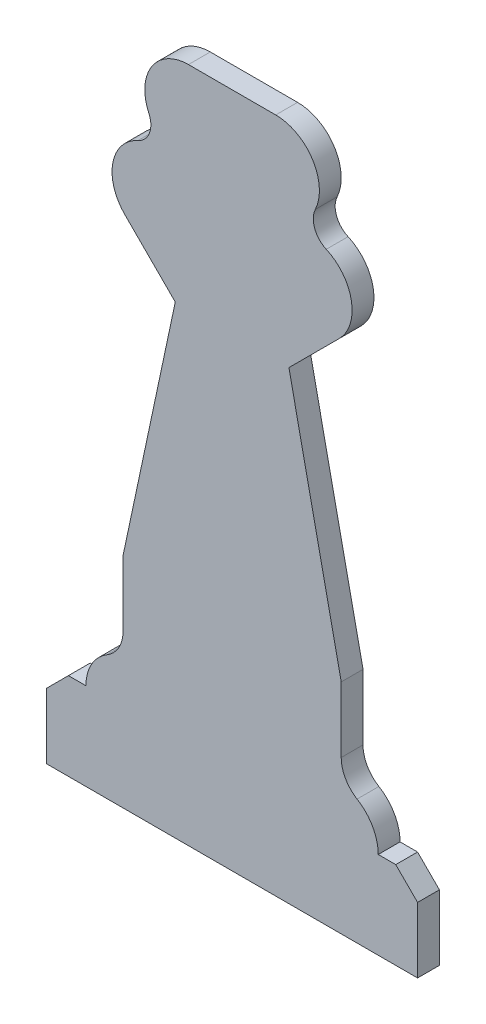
from build123d import *

# Parameters (mm, degrees)
SALIENTE_EXTRUIR1_DEPTH = 2


with BuildPart() as part:
    # Peon → Saliente-Extruir1 (new body)
    with BuildSketch(Plane.XY):
        with BuildLine():
            Line((-17, 0), (17, 0))
            Line((17, 0), (17, 6))
            Line((17, 6), (15, 8))
            Line((15, 8), (13.394448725, 8))
            ThreePointArc((13.394448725, 8), (12.875918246, 9.969611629), (11.454763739, 11.428571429))
            ThreePointArc((11.454763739, 11.428571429), (10.388897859, 12.522791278), (10, 14))
            Line((10, 14), (10, 20))
            Line((10, 20), (5.206850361, 42.549996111))
            Line((5.206850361, 42.549996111), (9.828427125, 47.171572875))
            ThreePointArc((9.828427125, 47.171572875), (10.933312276, 50.727361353), (8.629883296, 53.652872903))
            ThreePointArc((8.629883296, 53.652872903), (7.572166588, 54.777062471), (7.629883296, 56.319539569))
            ThreePointArc((7.629883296, 56.319539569), (7.370596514, 60.153852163), (4, 62))
            Line((4, 62), (-4, 62))
            ThreePointArc((-4, 62), (-7.370596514, 60.153852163), (-7.629883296, 56.319539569))
            ThreePointArc((-7.629883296, 56.319539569), (-7.572166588, 54.777062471), (-8.629883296, 53.652872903))
            ThreePointArc((-8.629883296, 53.652872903), (-10.933312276, 50.727361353), (-9.828427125, 47.171572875))
            Line((-9.828427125, 47.171572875), (-5.206850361, 42.549996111))
            Line((-5.206850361, 42.549996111), (-10, 20))
            Line((-10, 20), (-10, 14))
            ThreePointArc((-10, 14), (-10.388897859, 12.522791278), (-11.454763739, 11.428571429))
            ThreePointArc((-11.454763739, 11.428571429), (-12.875918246, 9.969611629), (-13.394448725, 8))
            Line((-13.394448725, 8), (-15, 8))
            Line((-15, 8), (-17, 6))
            Line((-17, 6), (-17, 0))
        make_face()
    extrude(amount=SALIENTE_EXTRUIR1_DEPTH)


solid = part.part
